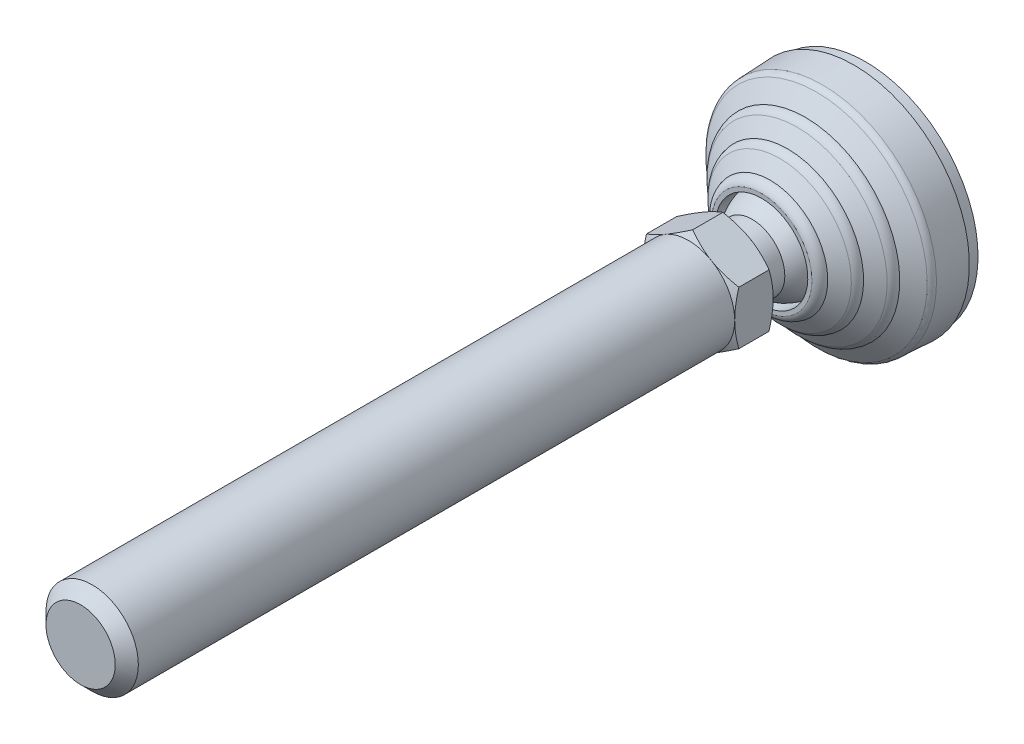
ISO-10303-21;
HEADER;
FILE_DESCRIPTION(('STEP AP214'),'2;1');
FILE_NAME('part.step','',(''),(''),'','','');
FILE_SCHEMA(('AUTOMOTIVE_DESIGN { 1 0 10303 214 1 1 1 1 }'));
ENDSEC;
DATA;
#1=APPLICATION_CONTEXT('core data for automotive mechanical design processes');
#2=APPLICATION_PROTOCOL_DEFINITION('international standard','automotive_design',2000,#1);
#3=PRODUCT_CONTEXT('',#1,'mechanical');
#4=PRODUCT('Part','Part','',(#3));
#5=PRODUCT_RELATED_PRODUCT_CATEGORY('part','',(#4));
#6=PRODUCT_DEFINITION_FORMATION('','',#4);
#7=PRODUCT_DEFINITION_CONTEXT('part definition',#1,'design');
#8=PRODUCT_DEFINITION('design','',#6,#7);
#9=PRODUCT_DEFINITION_SHAPE('','',#8);
#10=(LENGTH_UNIT() NAMED_UNIT(*) SI_UNIT(.MILLI.,.METRE.));
#11=(NAMED_UNIT(*) PLANE_ANGLE_UNIT() SI_UNIT($,.RADIAN.));
#12=(NAMED_UNIT(*) SI_UNIT($,.STERADIAN.) SOLID_ANGLE_UNIT());
#13=UNCERTAINTY_MEASURE_WITH_UNIT(LENGTH_MEASURE(1.E-05),#10,'distance_accuracy_value','');
#14=(GEOMETRIC_REPRESENTATION_CONTEXT(3) GLOBAL_UNCERTAINTY_ASSIGNED_CONTEXT((#13)) GLOBAL_UNIT_ASSIGNED_CONTEXT((#10,
#11,#12)) REPRESENTATION_CONTEXT('',''));
#15=CARTESIAN_POINT('',(0.,0.,0.));
#16=DIRECTION('',(0.,0.,1.));
#17=DIRECTION('',(1.,0.,0.));
#18=AXIS2_PLACEMENT_3D('',#15,#16,#17);
#19=CARTESIAN_POINT('',(0.,0.,93.1595));
#20=DIRECTION('',(0.,0.,-1.));
#21=DIRECTION('',(0.,1.,0.));
#22=AXIS2_PLACEMENT_3D('',#19,#20,#21);
#23=CYLINDRICAL_SURFACE('',#22,12.);
#24=CARTESIAN_POINT('',(0.,0.,201.));
#25=DIRECTION('',(0.,0.,1.));
#26=DIRECTION('',(0.,-1.,0.));
#27=AXIS2_PLACEMENT_3D('',#24,#25,#26);
#28=CIRCLE('',#27,12.);
#29=CARTESIAN_POINT('',(0.,-12.,201.));
#30=VERTEX_POINT('',#29);
#31=EDGE_CURVE('E9',#30,#30,#28,.F.);
#32=ORIENTED_EDGE('',*,*,#31,.T.);
#33=EDGE_LOOP('',(#32));
#34=FACE_BOUND('',#33,.T.);
#35=CARTESIAN_POINT('',(0.,0.,46.));
#36=DIRECTION('',(0.,0.,-1.));
#37=DIRECTION('',(0.,1.,0.));
#38=AXIS2_PLACEMENT_3D('',#35,#36,#37);
#39=CIRCLE('',#38,12.);
#40=CARTESIAN_POINT('',(0.,12.,46.));
#41=VERTEX_POINT('',#40);
#42=EDGE_CURVE('E124',#41,#41,#39,.F.);
#43=ORIENTED_EDGE('',*,*,#42,.T.);
#44=EDGE_LOOP('',(#43));
#45=FACE_BOUND('',#44,.T.);
#46=ADVANCED_FACE('F14',(#34,#45),#23,.T.);
#47=CARTESIAN_POINT('',(11.995,0.,46.));
#48=DIRECTION('',(0.,0.,-1.));
#49=DIRECTION('',(0.,1.,0.));
#50=AXIS2_PLACEMENT_3D('',#47,#48,#49);
#51=PLANE('',#50);
#52=CARTESIAN_POINT('',(0.,0.,46.));
#53=DIRECTION('',(0.,0.,-1.));
#54=DIRECTION('',(0.,1.,0.));
#55=AXIS2_PLACEMENT_3D('',#52,#53,#54);
#56=CIRCLE('',#55,11.99);
#57=CARTESIAN_POINT('',(0.,11.99,46.));
#58=VERTEX_POINT('',#57);
#59=EDGE_CURVE('E132',#58,#58,#56,.F.);
#60=ORIENTED_EDGE('',*,*,#59,.T.);
#61=EDGE_LOOP('',(#60));
#62=FACE_BOUND('',#61,.T.);
#63=ORIENTED_EDGE('',*,*,#42,.F.);
#64=EDGE_LOOP('',(#63));
#65=FACE_BOUND('',#64,.T.);
#66=ADVANCED_FACE('F157',(#62,#65),#51,.T.);
#67=CARTESIAN_POINT('',(0.,0.,44.9159643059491));
#68=DIRECTION('',(0.,0.,-1.));
#69=DIRECTION('',(0.,1.,0.));
#70=AXIS2_PLACEMENT_3D('',#67,#68,#69);
#71=CONICAL_SURFACE('',#70,13.8676048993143,1.0471975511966);
#72=ORIENTED_EDGE('',*,*,#59,.F.);
#73=EDGE_LOOP('',(#72));
#74=FACE_BOUND('',#73,.T.);
#75=CARTESIAN_POINT('',(-2.88482840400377E-08,-13.8564064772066,44.9224297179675));
#76=CARTESIAN_POINT('',(0.263784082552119,-13.7041106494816,45.010340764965));
#77=CARTESIAN_POINT('',(0.528551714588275,-13.5512469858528,45.0942615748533));
#78=CARTESIAN_POINT('',(1.06021019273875,-13.2442938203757,45.2530155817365));
#79=CARTESIAN_POINT('',(1.32710170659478,-13.0902039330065,45.3278457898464));
#80=CARTESIAN_POINT('',(2.13207647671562,-12.6254515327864,45.537252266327));
#81=CARTESIAN_POINT('',(2.67333741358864,-12.3129543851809,45.6563603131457));
#82=CARTESIAN_POINT('',(3.48330954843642,-11.8453167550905,45.796023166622));
#83=CARTESIAN_POINT('',(3.74960108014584,-11.6915732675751,45.8358073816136));
#84=CARTESIAN_POINT('',(4.28341699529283,-11.3833745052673,45.9025217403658));
#85=CARTESIAN_POINT('',(4.55094140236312,-11.2289192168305,45.9294516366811));
#86=CARTESIAN_POINT('',(5.08643614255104,-10.9197511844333,45.9697675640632));
#87=CARTESIAN_POINT('',(5.35440556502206,-10.7650389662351,45.9831696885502));
#88=CARTESIAN_POINT('',(5.8905925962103,-10.4554712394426,45.996144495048));
#89=CARTESIAN_POINT('',(6.15881019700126,-10.3006157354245,45.9957176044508));
#90=CARTESIAN_POINT('',(6.66023029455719,-10.0111207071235,45.9820002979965));
#91=CARTESIAN_POINT('',(6.89346857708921,-9.87646052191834,45.97038309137));
#92=CARTESIAN_POINT('',(7.35940867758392,-9.60744987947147,45.9369099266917));
#93=CARTESIAN_POINT('',(7.59211045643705,-9.47309944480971,45.9150532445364));
#94=CARTESIAN_POINT('',(8.05685109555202,-9.20478131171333,45.8614821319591));
#95=CARTESIAN_POINT('',(8.28888924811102,-9.07081402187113,45.8297595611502));
#96=CARTESIAN_POINT('',(8.75187776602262,-8.80350747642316,45.7570131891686));
#97=CARTESIAN_POINT('',(8.98282805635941,-8.67016826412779,45.7159887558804));
#98=CARTESIAN_POINT('',(9.68388987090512,-8.26541003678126,45.5779256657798));
#99=CARTESIAN_POINT('',(10.1519713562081,-7.99516306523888,45.4671213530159));
#100=CARTESIAN_POINT('',(11.081155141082,-7.45869855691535,45.2156417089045));
#101=CARTESIAN_POINT('',(11.5422693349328,-7.19247415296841,45.075025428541));
#102=CARTESIAN_POINT('',(11.9999999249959,-6.92820327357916,44.922429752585));
#103=B_SPLINE_CURVE_WITH_KNOTS('',3,(#75,#76,#77,#78,#79,#80,#81,#82,#83,#84,#85,#86,#87,#88,
#89,#90,#91,#92,#93,#94,#95,#96,#97,#98,#99,#100,#101,#102),.UNSPECIFIED.,.F.,.F.,(4,2,2,2,2,2,
2,2,2,2,2,2,2,4),(0.,0.950996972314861,1.90230578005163,3.80897261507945,4.73890631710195,
5.6688579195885,6.59770188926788,7.52651715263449,8.33503482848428,9.14360968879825,
9.95285348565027,10.7621522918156,12.4163368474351,14.0672749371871),.UNSPECIFIED.);
#104=CARTESIAN_POINT('',(-1.44241383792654E-08,-13.8564064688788,44.9224297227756));
#105=VERTEX_POINT('',#104);
#106=CARTESIAN_POINT('',(12.,-6.92820324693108,44.9224297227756));
#107=VERTEX_POINT('',#106);
#108=EDGE_CURVE('E143',#105,#107,#103,.T.);
#109=ORIENTED_EDGE('',*,*,#108,.T.);
#110=CARTESIAN_POINT('',(12.,-6.92820326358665,44.9224297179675));
#111=CARTESIAN_POINT('',(12.,-6.64374493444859,45.0045333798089));
#112=CARTESIAN_POINT('',(12.,-6.35829458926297,45.0831531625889));
#113=CARTESIAN_POINT('',(12.,-5.78524260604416,45.2325348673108));
#114=CARTESIAN_POINT('',(12.,-5.49764024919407,45.3032940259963));
#115=CARTESIAN_POINT('',(12.,-4.63053083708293,45.5026195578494));
#116=CARTESIAN_POINT('',(12.,-4.04782834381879,45.6179071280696));
#117=CARTESIAN_POINT('',(12.,-3.17548925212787,45.7575170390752));
#118=CARTESIAN_POINT('',(12.,-2.88840964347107,45.7982045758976));
#119=CARTESIAN_POINT('',(12.,-2.31290718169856,45.8685767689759));
#120=CARTESIAN_POINT('',(12.,-2.02448443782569,45.8982623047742));
#121=CARTESIAN_POINT('',(12.,-1.44696804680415,45.9459902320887));
#122=CARTESIAN_POINT('',(12.,-1.15787537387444,45.9640443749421));
#123=CARTESIAN_POINT('',(12.,-0.579188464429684,45.9881624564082));
#124=CARTESIAN_POINT('',(12.,-0.289594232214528,45.994226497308));
#125=CARTESIAN_POINT('',(12.,0.289594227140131,45.9942264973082));
#126=CARTESIAN_POINT('',(12.,0.579188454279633,45.9881624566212));
#127=CARTESIAN_POINT('',(12.,1.15787535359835,45.9640443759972));
#128=CARTESIAN_POINT('',(12.,1.44696802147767,45.9459902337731));
#129=CARTESIAN_POINT('',(12.,2.02448440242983,45.8982623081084));
#130=CARTESIAN_POINT('',(12.,2.31290714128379,45.8685767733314));
#131=CARTESIAN_POINT('',(12.,2.88840959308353,45.798204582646));
#132=CARTESIAN_POINT('',(12.,3.17548919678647,45.7575170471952));
#133=CARTESIAN_POINT('',(12.,4.04782827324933,45.6179071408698));
#134=CARTESIAN_POINT('',(12.,4.63053075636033,45.5026195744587));
#135=CARTESIAN_POINT('',(12.,5.49764015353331,45.3032940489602));
#136=CARTESIAN_POINT('',(12.,5.78524250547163,45.2325348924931));
#137=CARTESIAN_POINT('',(12.,6.35829447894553,45.0831531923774));
#138=CARTESIAN_POINT('',(12.,6.64374481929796,45.004533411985));
#139=CARTESIAN_POINT('',(12.,6.92820314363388,44.9224297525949));
#140=B_SPLINE_CURVE_WITH_KNOTS('',3,(#110,#111,#112,#113,#114,#115,#116,#117,#118,#119,#120,
#121,#122,#123,#124,#125,#126,#127,#128,#129,#130,#131,#132,#133,#134,#135,#136,#137,#138,#139),
.UNSPECIFIED.,.F.,.F.,(4,2,2,2,2,2,2,2,2,2,2,2,2,2,4),(0.,0.888148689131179,1.77660860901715,
3.55698615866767,4.42666281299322,5.2962699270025,6.16499708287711,7.03371682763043,
7.90243655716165,8.7711636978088,9.64077079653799,10.5104474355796,12.2908249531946,
13.1792848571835,14.0674335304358),.UNSPECIFIED.);
#141=CARTESIAN_POINT('',(12.0000000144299,6.92820322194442,44.9224297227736));
#142=VERTEX_POINT('',#141);
#143=EDGE_CURVE('E135',#107,#142,#140,.T.);
#144=ORIENTED_EDGE('',*,*,#143,.T.);
#145=CARTESIAN_POINT('',(12.0000000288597,6.92820321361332,44.9224297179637));
#146=CARTESIAN_POINT('',(11.7362159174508,7.08049904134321,45.0103407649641));
#147=CARTESIAN_POINT('',(11.4714482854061,7.23336270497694,45.0942615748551));
#148=CARTESIAN_POINT('',(10.9397898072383,7.54031587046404,45.2530155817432));
#149=CARTESIAN_POINT('',(10.6728982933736,7.69440575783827,45.3278457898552));
#150=CARTESIAN_POINT('',(9.86792352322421,8.15915815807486,45.5372522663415));
#151=CARTESIAN_POINT('',(9.32666258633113,8.47165530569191,45.6563603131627));
#152=CARTESIAN_POINT('',(8.51669045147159,8.93929293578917,45.7960231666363));
#153=CARTESIAN_POINT('',(8.25039891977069,9.0930364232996,45.8358073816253));
#154=CARTESIAN_POINT('',(7.71658300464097,9.40123518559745,45.9025217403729));
#155=CARTESIAN_POINT('',(7.44905859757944,9.55569047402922,45.9294516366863));
#156=CARTESIAN_POINT('',(6.91356385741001,9.86485850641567,45.9697675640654));
#157=CARTESIAN_POINT('',(6.64559443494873,10.0195707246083,45.9831696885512));
#158=CARTESIAN_POINT('',(6.10940740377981,10.3291384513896,45.996144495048));
#159=CARTESIAN_POINT('',(5.84118980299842,10.4839939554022,45.9957176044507));
#160=CARTESIAN_POINT('',(5.33976970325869,10.773488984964,45.9820002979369));
#161=CARTESIAN_POINT('',(5.10653141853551,10.9081491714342,45.970383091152));
#162=CARTESIAN_POINT('',(4.64059131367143,11.1771598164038,45.9369099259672));
#163=CARTESIAN_POINT('',(4.4078895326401,11.3115102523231,45.9150532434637));
#164=CARTESIAN_POINT('',(3.94314888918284,11.5798283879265,45.8614821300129));
#165=CARTESIAN_POINT('',(3.71111073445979,11.7137956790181,45.8297595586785));
#166=CARTESIAN_POINT('',(3.24812221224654,11.9811022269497,45.7570131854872));
#167=CARTESIAN_POINT('',(3.01717191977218,12.1144414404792,45.7159887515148));
#168=CARTESIAN_POINT('',(2.31611009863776,12.5191996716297,45.5779256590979));
#169=CARTESIAN_POINT('',(1.84802860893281,12.7894466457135,45.4671213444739));
#170=CARTESIAN_POINT('',(0.918844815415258,13.3259111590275,45.2156416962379));
#171=CARTESIAN_POINT('',(0.457730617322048,13.5921355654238,45.0750254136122));
#172=CARTESIAN_POINT('',(2.30778996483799E-08,13.856406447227,44.9224297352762));
#173=B_SPLINE_CURVE_WITH_KNOTS('',3,(#145,#146,#147,#148,#149,#150,#151,#152,#153,#154,#155,
#156,#157,#158,#159,#160,#161,#162,#163,#164,#165,#166,#167,#168,#169,#170,#171,#172),
.UNSPECIFIED.,.F.,.F.,(4,2,2,2,2,2,2,2,2,2,2,2,2,4),(0.,0.95099697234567,1.9023057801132,
3.8089726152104,4.73890631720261,5.66885791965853,6.59770188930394,7.52651715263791,
8.33503483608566,9.14360970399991,9.95285350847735,10.7621523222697,12.4163368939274,
14.0672749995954),.UNSPECIFIED.);
#174=CARTESIAN_POINT('',(-1.15389586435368E-08,13.856406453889,44.92242973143));
#175=VERTEX_POINT('',#174);
#176=EDGE_CURVE('E180',#142,#175,#173,.T.);
#177=ORIENTED_EDGE('',*,*,#176,.T.);
#178=CARTESIAN_POINT('',(-2.30779106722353E-08,13.856406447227,44.9224297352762));
#179=CARTESIAN_POINT('',(-0.263784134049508,13.7041106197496,45.0103407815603));
#180=CARTESIAN_POINT('',(-0.528551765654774,13.5512469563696,45.0942615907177));
#181=CARTESIAN_POINT('',(-1.06021024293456,13.2442937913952,45.2530155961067));
#182=CARTESIAN_POINT('',(-1.32710175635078,13.0902039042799,45.3278458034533));
#183=CARTESIAN_POINT('',(-2.13207652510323,12.6254515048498,45.5372522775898));
#184=CARTESIAN_POINT('',(-2.67333746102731,12.3129543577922,45.656360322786));
#185=CARTESIAN_POINT('',(-3.48330959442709,11.8453167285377,45.7960231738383));
#186=CARTESIAN_POINT('',(-3.74960112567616,11.6915732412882,45.8358073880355));
#187=CARTESIAN_POINT('',(-4.28341703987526,11.3833744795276,45.9025217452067));
#188=CARTESIAN_POINT('',(-4.55094144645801,11.2289191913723,45.9294516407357));
#189=CARTESIAN_POINT('',(-5.08643618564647,10.9197511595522,45.9697675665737));
#190=CARTESIAN_POINT('',(-5.35440560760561,10.7650389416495,45.9831696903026));
#191=CARTESIAN_POINT('',(-5.89059263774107,10.4554712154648,45.9961444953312));
#192=CARTESIAN_POINT('',(-6.15881023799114,10.300615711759,45.9957176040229));
#193=CARTESIAN_POINT('',(-6.66023033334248,10.0111206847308,45.9820002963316));
#194=CARTESIAN_POINT('',(-6.89346861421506,9.87646050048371,45.9703830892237));
#195=CARTESIAN_POINT('',(-7.35940871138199,9.60744985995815,45.9369099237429));
#196=CARTESIAN_POINT('',(-7.59211048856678,9.4730994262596,45.9150532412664));
#197=CARTESIAN_POINT('',(-8.05685112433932,9.20478129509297,45.8614821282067));
#198=CARTESIAN_POINT('',(-8.28888927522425,9.0708140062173,45.8297595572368));
#199=CARTESIAN_POINT('',(-8.75187778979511,8.8035074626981,45.7570131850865));
#200=CARTESIAN_POINT('',(-8.98282807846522,8.67016825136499,45.7159887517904));
#201=CARTESIAN_POINT('',(-9.68388988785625,8.26541002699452,45.5779256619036));
#202=CARTESIAN_POINT('',(-10.1519713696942,7.9951630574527,45.4671213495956));
#203=CARTESIAN_POINT('',(-11.0811551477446,7.45869855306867,45.2156417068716));
#204=CARTESIAN_POINT('',(-11.5422693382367,7.19247415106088,45.0750254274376));
#205=CARTESIAN_POINT('',(-11.9999999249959,6.92820327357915,44.922429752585));
#206=B_SPLINE_CURVE_WITH_KNOTS('',3,(#178,#179,#180,#181,#182,#183,#184,#185,#186,#187,#188,
#189,#190,#191,#192,#193,#194,#195,#196,#197,#198,#199,#200,#201,#202,#203,#204,#205),
.UNSPECIFIED.,.F.,.F.,(4,2,2,2,2,2,2,2,2,2,2,2,2,4),(0.,0.9509969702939,1.90230577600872,
3.80897260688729,4.73890630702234,5.6688579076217,6.5977018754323,7.52651713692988,
8.33503480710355,9.14360966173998,9.95285345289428,10.7621522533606,12.4163367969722,
14.067274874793),.UNSPECIFIED.);
#207=CARTESIAN_POINT('',(-12.,6.92820324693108,44.9224297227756));
#208=VERTEX_POINT('',#207);
#209=EDGE_CURVE('E172',#175,#208,#206,.T.);
#210=ORIENTED_EDGE('',*,*,#209,.T.);
#211=CARTESIAN_POINT('',(-12.,6.92820326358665,44.9224297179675));
#212=CARTESIAN_POINT('',(-12.,6.64374493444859,45.0045333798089));
#213=CARTESIAN_POINT('',(-12.,6.35829458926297,45.0831531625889));
#214=CARTESIAN_POINT('',(-12.,5.78524260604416,45.2325348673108));
#215=CARTESIAN_POINT('',(-12.,5.49764024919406,45.3032940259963));
#216=CARTESIAN_POINT('',(-12.,4.63053083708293,45.5026195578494));
#217=CARTESIAN_POINT('',(-12.,4.04782834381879,45.6179071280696));
#218=CARTESIAN_POINT('',(-12.,3.17548925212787,45.7575170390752));
#219=CARTESIAN_POINT('',(-12.,2.88840964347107,45.7982045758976));
#220=CARTESIAN_POINT('',(-12.,2.31290718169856,45.8685767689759));
#221=CARTESIAN_POINT('',(-12.,2.02448443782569,45.8982623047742));
#222=CARTESIAN_POINT('',(-12.,1.44696804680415,45.9459902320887));
#223=CARTESIAN_POINT('',(-12.,1.15787537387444,45.9640443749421));
#224=CARTESIAN_POINT('',(-12.,0.579188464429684,45.9881624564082));
#225=CARTESIAN_POINT('',(-12.,0.289594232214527,45.994226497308));
#226=CARTESIAN_POINT('',(-12.,-0.289594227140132,45.9942264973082));
#227=CARTESIAN_POINT('',(-12.,-0.579188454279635,45.9881624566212));
#228=CARTESIAN_POINT('',(-12.,-1.15787535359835,45.9640443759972));
#229=CARTESIAN_POINT('',(-12.,-1.44696802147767,45.9459902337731));
#230=CARTESIAN_POINT('',(-12.,-2.02448440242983,45.8982623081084));
#231=CARTESIAN_POINT('',(-12.,-2.31290714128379,45.8685767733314));
#232=CARTESIAN_POINT('',(-12.,-2.88840959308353,45.798204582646));
#233=CARTESIAN_POINT('',(-12.,-3.17548919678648,45.7575170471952));
#234=CARTESIAN_POINT('',(-12.,-4.04782827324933,45.6179071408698));
#235=CARTESIAN_POINT('',(-12.,-4.63053075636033,45.5026195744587));
#236=CARTESIAN_POINT('',(-12.,-5.49764015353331,45.3032940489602));
#237=CARTESIAN_POINT('',(-12.,-5.78524250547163,45.2325348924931));
#238=CARTESIAN_POINT('',(-12.,-6.35829447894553,45.0831531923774));
#239=CARTESIAN_POINT('',(-12.,-6.64374481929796,45.004533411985));
#240=CARTESIAN_POINT('',(-12.,-6.92820314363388,44.9224297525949));
#241=B_SPLINE_CURVE_WITH_KNOTS('',3,(#211,#212,#213,#214,#215,#216,#217,#218,#219,#220,#221,
#222,#223,#224,#225,#226,#227,#228,#229,#230,#231,#232,#233,#234,#235,#236,#237,#238,#239,#240),
.UNSPECIFIED.,.F.,.F.,(4,2,2,2,2,2,2,2,2,2,2,2,2,2,4),(0.,0.888148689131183,1.77660860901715,
3.55698615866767,4.42666281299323,5.2962699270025,6.16499708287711,7.03371682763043,
7.90243655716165,8.7711636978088,9.64077079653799,10.5104474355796,12.2908249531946,
13.1792848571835,14.0674335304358),.UNSPECIFIED.);
#242=CARTESIAN_POINT('',(-12.0000000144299,-6.92820322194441,44.9224297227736));
#243=VERTEX_POINT('',#242);
#244=EDGE_CURVE('E350',#208,#243,#241,.T.);
#245=ORIENTED_EDGE('',*,*,#244,.T.);
#246=CARTESIAN_POINT('',(-12.0000000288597,-6.92820321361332,44.9224297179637));
#247=CARTESIAN_POINT('',(-11.7362159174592,-7.08049904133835,45.0103407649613));
#248=CARTESIAN_POINT('',(-11.471448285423,-7.23336270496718,45.0942615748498));
#249=CARTESIAN_POINT('',(-10.9397898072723,-7.54031587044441,45.2530155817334));
#250=CARTESIAN_POINT('',(-10.6728982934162,-7.69440575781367,45.3278457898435));
#251=CARTESIAN_POINT('',(-9.86792352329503,-8.15915815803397,45.5372522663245));
#252=CARTESIAN_POINT('',(-9.32666258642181,-8.47165530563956,45.6563603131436));
#253=CARTESIAN_POINT('',(-8.51669045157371,-8.93929293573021,45.7960231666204));
#254=CARTESIAN_POINT('',(-8.25039891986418,-9.09303642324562,45.8358073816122));
#255=CARTESIAN_POINT('',(-7.71658300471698,-9.40123518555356,45.9025217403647));
#256=CARTESIAN_POINT('',(-7.44905859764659,-9.55569047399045,45.9294516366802));
#257=CARTESIAN_POINT('',(-6.91356385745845,-9.8648585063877,45.9697675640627));
#258=CARTESIAN_POINT('',(-6.64559443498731,-10.019570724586,45.9831696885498));
#259=CARTESIAN_POINT('',(-6.10940740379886,-10.3291384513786,45.996144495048));
#260=CARTESIAN_POINT('',(-5.84118980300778,-10.4839939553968,45.9957176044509));
#261=CARTESIAN_POINT('',(-5.33976970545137,-10.7734889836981,45.9820002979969));
#262=CARTESIAN_POINT('',(-5.10653142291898,-10.9081491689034,45.9703830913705));
#263=CARTESIAN_POINT('',(-4.64059132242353,-11.1771598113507,45.9369099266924));
#264=CARTESIAN_POINT('',(-4.40788954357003,-11.3115102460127,45.9150532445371));
#265=CARTESIAN_POINT('',(-3.94314890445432,-11.5798283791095,45.8614821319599));
#266=CARTESIAN_POINT('',(-3.71111075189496,-11.7137956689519,45.8297595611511));
#267=CARTESIAN_POINT('',(-3.24812223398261,-11.9811022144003,45.7570131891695));
#268=CARTESIAN_POINT('',(-3.01717194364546,-12.1144414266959,45.7159887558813));
#269=CARTESIAN_POINT('',(-2.3161101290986,-12.5191996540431,45.5779256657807));
#270=CARTESIAN_POINT('',(-1.84802864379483,-12.7894466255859,45.4671213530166));
#271=CARTESIAN_POINT('',(-0.918844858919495,-13.3259111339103,45.215641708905));
#272=CARTESIAN_POINT('',(-0.457730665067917,-13.5921355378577,45.0750254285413));
#273=CARTESIAN_POINT('',(-7.50040968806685E-08,-13.8564064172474,44.922429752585));
#274=B_SPLINE_CURVE_WITH_KNOTS('',3,(#246,#247,#248,#249,#250,#251,#252,#253,#254,#255,#256,
#257,#258,#259,#260,#261,#262,#263,#264,#265,#266,#267,#268,#269,#270,#271,#272,#273),
.UNSPECIFIED.,.F.,.F.,(4,2,2,2,2,2,2,2,2,2,2,2,2,4),(0.,0.950996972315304,1.90230578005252,
3.80897261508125,4.73890631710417,5.66885791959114,6.59770188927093,7.52651715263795,
8.33503482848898,9.14360968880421,9.95285348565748,10.7621522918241,12.4163368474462,
14.0672749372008),.UNSPECIFIED.);
#275=EDGE_CURVE('E162',#243,#105,#274,.T.);
#276=ORIENTED_EDGE('',*,*,#275,.T.);
#277=EDGE_LOOP('',(#109,#144,#177,#210,#245,#276));
#278=FACE_BOUND('',#277,.T.);
#279=ADVANCED_FACE('F152',(#74,#278),#71,.T.);
#280=CARTESIAN_POINT('',(0.,-13.856406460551,46.1));
#281=DIRECTION('',(0.5,0.866025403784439,0.));
#282=DIRECTION('',(-0.866025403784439,0.5,0.));
#283=AXIS2_PLACEMENT_3D('',#280,#281,#282);
#284=PLANE('',#283);
#285=DIRECTION('',(0.,0.,1.));
#286=VECTOR('',#285,1.);
#287=CARTESIAN_POINT('',(0.,-13.856406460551,46.1));
#288=LINE('',#287,#286);
#289=CARTESIAN_POINT('',(0.,-13.856406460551,37.0775702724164));
#290=VERTEX_POINT('',#289);
#291=EDGE_CURVE('E376',#290,#105,#288,.T.);
#292=ORIENTED_EDGE('',*,*,#291,.T.);
#293=ORIENTED_EDGE('',*,*,#275,.F.);
#294=DIRECTION('',(0.,0.,1.));
#295=VECTOR('',#294,1.);
#296=CARTESIAN_POINT('',(-12.,-6.9282032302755,46.1));
#297=LINE('',#296,#295);
#298=CARTESIAN_POINT('',(-12.,-6.9282032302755,37.0775702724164));
#299=VERTEX_POINT('',#298);
#300=EDGE_CURVE('E368',#299,#243,#297,.T.);
#301=ORIENTED_EDGE('',*,*,#300,.F.);
#302=CARTESIAN_POINT('',(0.,-13.856406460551,37.0775702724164));
#303=CARTESIAN_POINT('',(-0.263784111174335,-13.7041106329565,36.9896592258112));
#304=CARTESIAN_POINT('',(-0.528551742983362,-13.5512469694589,36.9057384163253));
#305=CARTESIAN_POINT('',(-1.0602102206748,-13.2442938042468,36.7469844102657));
#306=CARTESIAN_POINT('',(-1.32710173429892,-13.0902039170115,36.6721542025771));
#307=CARTESIAN_POINT('',(-2.13207650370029,-12.6254515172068,36.4627477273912));
#308=CARTESIAN_POINT('',(-2.67333744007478,-12.3129543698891,36.3436396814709));
#309=CARTESIAN_POINT('',(-3.48330957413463,-11.8453167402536,36.2039768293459));
#310=CARTESIAN_POINT('',(-3.74960110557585,-11.6915732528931,36.1641926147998));
#311=CARTESIAN_POINT('',(-4.28341702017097,-11.3833744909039,36.097478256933));
#312=CARTESIAN_POINT('',(-4.55094142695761,-11.2289192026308,36.0705483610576));
#313=CARTESIAN_POINT('',(-5.08643616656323,-10.9197511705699,36.0302324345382));
#314=CARTESIAN_POINT('',(-5.35440558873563,-10.765038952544,36.0168303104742));
#315=CARTESIAN_POINT('',(-5.89059261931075,-10.4554712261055,36.0038555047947));
#316=CARTESIAN_POINT('',(-6.15881021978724,-10.300615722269,36.0042823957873));
#317=CARTESIAN_POINT('',(-6.66023031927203,-10.0111206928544,36.0179997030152));
#318=CARTESIAN_POINT('',(-6.8934686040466,-9.87646050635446,36.029616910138));
#319=CARTESIAN_POINT('',(-7.35940870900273,-9.6074498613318,36.063090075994));
#320=CARTESIAN_POINT('',(-7.59211049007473,-9.47309942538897,36.0849467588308));
#321=CARTESIAN_POINT('',(-8.05685113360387,-9.20478128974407,36.1385178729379));
#322=CARTESIAN_POINT('',(-8.28888928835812,-9.07081399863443,36.1702404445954));
#323=CARTESIAN_POINT('',(-8.75187781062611,-8.8035074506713,36.2429868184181));
#324=CARTESIAN_POINT('',(-8.98282810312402,-8.67016823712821,36.2840112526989));
#325=CARTESIAN_POINT('',(-9.6838899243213,-8.2654100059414,36.4220743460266));
#326=CARTESIAN_POINT('',(-10.1519714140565,-7.99516303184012,36.5328786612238));
#327=CARTESIAN_POINT('',(-11.0811552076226,-7.45869851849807,36.7843583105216));
#328=CARTESIAN_POINT('',(-11.5422694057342,-7.19247411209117,36.924974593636));
#329=CARTESIAN_POINT('',(-12.,-6.9282032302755,37.0775702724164));
#330=B_SPLINE_CURVE_WITH_KNOTS('',3,(#302,#303,#304,#305,#306,#307,#308,#309,#310,#311,#312,
#313,#314,#315,#316,#317,#318,#319,#320,#321,#322,#323,#324,#325,#326,#327,#328,#329),
.UNSPECIFIED.,.F.,.F.,(4,2,2,2,2,2,2,2,2,2,2,2,2,4),(0.,0.950996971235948,1.90230577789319,
3.80897261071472,4.73890631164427,5.66885791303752,6.59770188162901,7.52651714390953,
8.33503482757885,9.14360969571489,9.9528535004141,10.7621523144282,12.4163368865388,
14.0672749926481),.UNSPECIFIED.);
#331=EDGE_CURVE('E370',#290,#299,#330,.T.);
#332=ORIENTED_EDGE('',*,*,#331,.F.);
#333=EDGE_LOOP('',(#292,#293,#301,#332));
#334=FACE_BOUND('',#333,.T.);
#335=ADVANCED_FACE('F156',(#334),#284,.F.);
#336=CARTESIAN_POINT('',(12.,-6.92820323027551,46.1));
#337=DIRECTION('',(-0.5,0.866025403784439,0.));
#338=DIRECTION('',(-0.866025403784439,-0.5,0.));
#339=AXIS2_PLACEMENT_3D('',#336,#337,#338);
#340=PLANE('',#339);
#341=DIRECTION('',(0.,0.,1.));
#342=VECTOR('',#341,1.);
#343=CARTESIAN_POINT('',(12.,-6.92820323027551,46.1));
#344=LINE('',#343,#342);
#345=CARTESIAN_POINT('',(12.,-6.92820323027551,37.0775702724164));
#346=VERTEX_POINT('',#345);
#347=EDGE_CURVE('E31',#346,#107,#344,.T.);
#348=ORIENTED_EDGE('',*,*,#347,.T.);
#349=ORIENTED_EDGE('',*,*,#108,.F.);
#350=ORIENTED_EDGE('',*,*,#291,.F.);
#351=CARTESIAN_POINT('',(12.,-6.92820323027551,37.0775702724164));
#352=CARTESIAN_POINT('',(11.7362158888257,-7.08049905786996,36.9896592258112));
#353=CARTESIAN_POINT('',(11.4714482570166,-7.2333627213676,36.9057384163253));
#354=CARTESIAN_POINT('',(10.9397897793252,-7.5403158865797,36.7469844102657));
#355=CARTESIAN_POINT('',(10.6728982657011,-7.69440577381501,36.6721542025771));
#356=CARTESIAN_POINT('',(9.86792349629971,-8.15915817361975,36.4627477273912));
#357=CARTESIAN_POINT('',(9.32666255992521,-8.4716553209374,36.3436396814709));
#358=CARTESIAN_POINT('',(8.51669042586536,-8.93929295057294,36.2039768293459));
#359=CARTESIAN_POINT('',(8.25039889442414,-9.09303643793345,36.1641926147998));
#360=CARTESIAN_POINT('',(7.71658297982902,-9.40123519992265,36.097478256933));
#361=CARTESIAN_POINT('',(7.44905857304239,-9.55569048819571,36.0705483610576));
#362=CARTESIAN_POINT('',(6.91356383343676,-9.86485852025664,36.0302324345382));
#363=CARTESIAN_POINT('',(6.64559441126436,-10.0195707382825,36.0168303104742));
#364=CARTESIAN_POINT('',(6.10940738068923,-10.329138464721,36.0038555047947));
#365=CARTESIAN_POINT('',(5.84118978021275,-10.4839939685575,36.0042823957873));
#366=CARTESIAN_POINT('',(5.33976968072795,-10.7734889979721,36.0179997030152));
#367=CARTESIAN_POINT('',(5.10653139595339,-10.9081491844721,36.029616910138));
#368=CARTESIAN_POINT('',(4.64059129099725,-11.1771598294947,36.063090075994));
#369=CARTESIAN_POINT('',(4.40788950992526,-11.3115102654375,36.0849467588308));
#370=CARTESIAN_POINT('',(3.94314886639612,-11.5798284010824,36.1385178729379));
#371=CARTESIAN_POINT('',(3.71111071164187,-11.7137956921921,36.1702404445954));
#372=CARTESIAN_POINT('',(3.24812218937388,-11.9811022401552,36.2429868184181));
#373=CARTESIAN_POINT('',(3.01717189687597,-12.1144414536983,36.2840112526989));
#374=CARTESIAN_POINT('',(2.3161100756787,-12.5191996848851,36.4220743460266));
#375=CARTESIAN_POINT('',(1.84802858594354,-12.7894466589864,36.5328786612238));
#376=CARTESIAN_POINT('',(0.918844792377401,-13.3259111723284,36.7843583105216));
#377=CARTESIAN_POINT('',(0.457730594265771,-13.5921355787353,36.924974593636));
#378=CARTESIAN_POINT('',(0.,-13.856406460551,37.0775702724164));
#379=B_SPLINE_CURVE_WITH_KNOTS('',3,(#351,#352,#353,#354,#355,#356,#357,#358,#359,#360,#361,
#362,#363,#364,#365,#366,#367,#368,#369,#370,#371,#372,#373,#374,#375,#376,#377,#378),
.UNSPECIFIED.,.F.,.F.,(4,2,2,2,2,2,2,2,2,2,2,2,2,4),(0.,0.95099697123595,1.90230577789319,
3.80897261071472,4.73890631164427,5.66885791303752,6.59770188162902,7.52651714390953,
8.33503482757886,9.14360969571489,9.9528535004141,10.7621523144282,12.4163368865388,
14.0672749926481),.UNSPECIFIED.);
#380=EDGE_CURVE('E377',#346,#290,#379,.T.);
#381=ORIENTED_EDGE('',*,*,#380,.F.);
#382=EDGE_LOOP('',(#348,#349,#350,#381));
#383=FACE_BOUND('',#382,.T.);
#384=ADVANCED_FACE('F383',(#383),#340,.F.);
#385=CARTESIAN_POINT('',(-12.,6.92820323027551,46.1));
#386=DIRECTION('',(0.5,-0.866025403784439,0.));
#387=DIRECTION('',(0.866025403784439,0.5,0.));
#388=AXIS2_PLACEMENT_3D('',#385,#386,#387);
#389=PLANE('',#388);
#390=DIRECTION('',(0.,0.,1.));
#391=VECTOR('',#390,1.);
#392=CARTESIAN_POINT('',(-12.,6.92820323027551,46.1));
#393=LINE('',#392,#391);
#394=CARTESIAN_POINT('',(-12.,6.92820323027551,37.0775702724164));
#395=VERTEX_POINT('',#394);
#396=EDGE_CURVE('E369',#395,#208,#393,.T.);
#397=ORIENTED_EDGE('',*,*,#396,.T.);
#398=ORIENTED_EDGE('',*,*,#209,.F.);
#399=DIRECTION('',(0.,0.,1.));
#400=VECTOR('',#399,1.);
#401=CARTESIAN_POINT('',(0.,13.856406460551,46.1));
#402=LINE('',#401,#400);
#403=CARTESIAN_POINT('',(0.,13.856406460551,37.0775702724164));
#404=VERTEX_POINT('',#403);
#405=EDGE_CURVE('E211',#404,#175,#402,.T.);
#406=ORIENTED_EDGE('',*,*,#405,.F.);
#407=CARTESIAN_POINT('',(-12.,6.92820323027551,37.0775702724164));
#408=CARTESIAN_POINT('',(-11.7362158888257,7.08049905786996,36.9896592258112));
#409=CARTESIAN_POINT('',(-11.4714482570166,7.2333627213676,36.9057384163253));
#410=CARTESIAN_POINT('',(-10.9397897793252,7.5403158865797,36.7469844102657));
#411=CARTESIAN_POINT('',(-10.6728982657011,7.69440577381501,36.6721542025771));
#412=CARTESIAN_POINT('',(-9.86792349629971,8.15915817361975,36.4627477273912));
#413=CARTESIAN_POINT('',(-9.32666255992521,8.4716553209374,36.3436396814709));
#414=CARTESIAN_POINT('',(-8.51669042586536,8.93929295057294,36.2039768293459));
#415=CARTESIAN_POINT('',(-8.25039889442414,9.09303643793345,36.1641926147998));
#416=CARTESIAN_POINT('',(-7.71658297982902,9.40123519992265,36.097478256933));
#417=CARTESIAN_POINT('',(-7.44905857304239,9.55569048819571,36.0705483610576));
#418=CARTESIAN_POINT('',(-6.91356383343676,9.86485852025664,36.0302324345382));
#419=CARTESIAN_POINT('',(-6.64559441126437,10.0195707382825,36.0168303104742));
#420=CARTESIAN_POINT('',(-6.10940738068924,10.329138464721,36.0038555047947));
#421=CARTESIAN_POINT('',(-5.84118978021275,10.4839939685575,36.0042823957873));
#422=CARTESIAN_POINT('',(-5.33976968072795,10.7734889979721,36.0179997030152));
#423=CARTESIAN_POINT('',(-5.10653139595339,10.9081491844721,36.029616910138));
#424=CARTESIAN_POINT('',(-4.64059129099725,11.1771598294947,36.063090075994));
#425=CARTESIAN_POINT('',(-4.40788950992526,11.3115102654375,36.0849467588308));
#426=CARTESIAN_POINT('',(-3.94314886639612,11.5798284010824,36.1385178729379));
#427=CARTESIAN_POINT('',(-3.71111071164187,11.7137956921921,36.1702404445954));
#428=CARTESIAN_POINT('',(-3.24812218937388,11.9811022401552,36.2429868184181));
#429=CARTESIAN_POINT('',(-3.01717189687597,12.1144414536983,36.2840112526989));
#430=CARTESIAN_POINT('',(-2.3161100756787,12.5191996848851,36.4220743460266));
#431=CARTESIAN_POINT('',(-1.84802858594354,12.7894466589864,36.5328786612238));
#432=CARTESIAN_POINT('',(-0.918844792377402,13.3259111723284,36.7843583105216));
#433=CARTESIAN_POINT('',(-0.457730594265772,13.5921355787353,36.924974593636));
#434=CARTESIAN_POINT('',(0.,13.856406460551,37.0775702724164));
#435=B_SPLINE_CURVE_WITH_KNOTS('',3,(#407,#408,#409,#410,#411,#412,#413,#414,#415,#416,#417,
#418,#419,#420,#421,#422,#423,#424,#425,#426,#427,#428,#429,#430,#431,#432,#433,#434),
.UNSPECIFIED.,.F.,.F.,(4,2,2,2,2,2,2,2,2,2,2,2,2,4),(0.,0.95099697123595,1.90230577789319,
3.80897261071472,4.73890631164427,5.66885791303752,6.59770188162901,7.52651714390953,
8.33503482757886,9.14360969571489,9.9528535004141,10.7621523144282,12.4163368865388,
14.0672749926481),.UNSPECIFIED.);
#436=EDGE_CURVE('E213',#395,#404,#435,.T.);
#437=ORIENTED_EDGE('',*,*,#436,.F.);
#438=EDGE_LOOP('',(#397,#398,#406,#437));
#439=FACE_BOUND('',#438,.T.);
#440=ADVANCED_FACE('F199',(#439),#389,.F.);
#441=CARTESIAN_POINT('',(-12.,-6.92820323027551,46.1));
#442=DIRECTION('',(1.,0.,0.));
#443=DIRECTION('',(0.,1.,0.));
#444=AXIS2_PLACEMENT_3D('',#441,#442,#443);
#445=PLANE('',#444);
#446=ORIENTED_EDGE('',*,*,#300,.T.);
#447=ORIENTED_EDGE('',*,*,#244,.F.);
#448=ORIENTED_EDGE('',*,*,#396,.F.);
#449=CARTESIAN_POINT('',(-12.,-6.9282032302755,37.0775702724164));
#450=CARTESIAN_POINT('',(-12.,-6.64374490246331,36.9954666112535));
#451=CARTESIAN_POINT('',(-12.,-6.35829455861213,36.9168468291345));
#452=CARTESIAN_POINT('',(-12.,-5.78524257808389,36.7674651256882));
#453=CARTESIAN_POINT('',(-12.,-5.49764022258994,36.6967059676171));
#454=CARTESIAN_POINT('',(-12.,-4.63053081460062,36.4973804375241));
#455=CARTESIAN_POINT('',(-12.,-4.04782832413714,36.3820928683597));
#456=CARTESIAN_POINT('',(-12.,-3.17548923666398,36.2424829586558));
#457=CARTESIAN_POINT('',(-12.,-2.88840962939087,36.2017954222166));
#458=CARTESIAN_POINT('',(-12.,-2.31290717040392,36.1314232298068));
#459=CARTESIAN_POINT('',(-12.,-2.02448442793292,36.1017376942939));
#460=CARTESIAN_POINT('',(-12.,-1.44696803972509,36.0540097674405));
#461=CARTESIAN_POINT('',(-12.,-1.1578753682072,36.035955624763));
#462=CARTESIAN_POINT('',(-12.,-0.579188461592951,36.0118375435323));
#463=CARTESIAN_POINT('',(-12.,-0.289594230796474,36.0057735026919));
#464=CARTESIAN_POINT('',(-12.,0.28959423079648,36.0057735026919));
#465=CARTESIAN_POINT('',(-12.,0.579188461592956,36.0118375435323));
#466=CARTESIAN_POINT('',(-12.,1.15787536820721,36.035955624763));
#467=CARTESIAN_POINT('',(-12.,1.4469680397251,36.0540097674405));
#468=CARTESIAN_POINT('',(-12.,2.02448442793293,36.1017376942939));
#469=CARTESIAN_POINT('',(-12.,2.31290717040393,36.1314232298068));
#470=CARTESIAN_POINT('',(-12.,2.88840962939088,36.2017954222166));
#471=CARTESIAN_POINT('',(-12.,3.17548923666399,36.2424829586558));
#472=CARTESIAN_POINT('',(-12.,4.04782832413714,36.3820928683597));
#473=CARTESIAN_POINT('',(-12.,4.63053081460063,36.4973804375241));
#474=CARTESIAN_POINT('',(-12.,5.49764022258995,36.6967059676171));
#475=CARTESIAN_POINT('',(-12.,5.7852425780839,36.7674651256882));
#476=CARTESIAN_POINT('',(-12.,6.35829455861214,36.9168468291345));
#477=CARTESIAN_POINT('',(-12.,6.64374490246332,36.9954666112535));
#478=CARTESIAN_POINT('',(-12.,6.92820323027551,37.0775702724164));
#479=B_SPLINE_CURVE_WITH_KNOTS('',3,(#449,#450,#451,#452,#453,#454,#455,#456,#457,#458,#459,
#460,#461,#462,#463,#464,#465,#466,#467,#468,#469,#470,#471,#472,#473,#474,#475,#476,#477,#478),
.UNSPECIFIED.,.F.,.F.,(4,2,2,2,2,2,2,2,2,2,2,2,2,2,4),(0.,0.888148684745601,1.77660860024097,
3.55698614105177,4.42666279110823,5.29626990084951,6.16499705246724,7.03371679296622,
7.90243653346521,8.77116368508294,9.64077079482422,10.5104474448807,12.2908249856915,
13.1792849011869,14.0674335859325),.UNSPECIFIED.);
#480=EDGE_CURVE('E362',#299,#395,#479,.T.);
#481=ORIENTED_EDGE('',*,*,#480,.F.);
#482=EDGE_LOOP('',(#446,#447,#448,#481));
#483=FACE_BOUND('',#482,.T.);
#484=ADVANCED_FACE('F356',(#483),#445,.F.);
#485=CARTESIAN_POINT('',(12.,6.92820323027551,46.1));
#486=DIRECTION('',(-1.,0.,0.));
#487=DIRECTION('',(0.,-1.,0.));
#488=AXIS2_PLACEMENT_3D('',#485,#486,#487);
#489=PLANE('',#488);
#490=DIRECTION('',(0.,0.,1.));
#491=VECTOR('',#490,1.);
#492=CARTESIAN_POINT('',(12.,6.92820323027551,46.1));
#493=LINE('',#492,#491);
#494=CARTESIAN_POINT('',(12.,6.9282032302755,37.0775702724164));
#495=VERTEX_POINT('',#494);
#496=EDGE_CURVE('E410',#142,#495,#493,.F.);
#497=ORIENTED_EDGE('',*,*,#496,.F.);
#498=ORIENTED_EDGE('',*,*,#143,.F.);
#499=ORIENTED_EDGE('',*,*,#347,.F.);
#500=CARTESIAN_POINT('',(12.,6.92820323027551,37.0775702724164));
#501=CARTESIAN_POINT('',(12.,6.64374490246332,36.9954666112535));
#502=CARTESIAN_POINT('',(12.,6.35829455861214,36.9168468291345));
#503=CARTESIAN_POINT('',(12.,5.7852425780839,36.7674651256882));
#504=CARTESIAN_POINT('',(12.,5.49764022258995,36.6967059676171));
#505=CARTESIAN_POINT('',(12.,4.63053081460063,36.4973804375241));
#506=CARTESIAN_POINT('',(12.,4.04782832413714,36.3820928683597));
#507=CARTESIAN_POINT('',(12.,3.17548923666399,36.2424829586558));
#508=CARTESIAN_POINT('',(12.,2.88840962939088,36.2017954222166));
#509=CARTESIAN_POINT('',(12.,2.31290717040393,36.1314232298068));
#510=CARTESIAN_POINT('',(12.,2.02448442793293,36.1017376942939));
#511=CARTESIAN_POINT('',(12.,1.4469680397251,36.0540097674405));
#512=CARTESIAN_POINT('',(12.,1.1578753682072,36.035955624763));
#513=CARTESIAN_POINT('',(12.,0.579188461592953,36.0118375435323));
#514=CARTESIAN_POINT('',(12.,0.289594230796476,36.0057735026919));
#515=CARTESIAN_POINT('',(12.,-0.289594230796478,36.0057735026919));
#516=CARTESIAN_POINT('',(12.,-0.579188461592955,36.0118375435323));
#517=CARTESIAN_POINT('',(12.,-1.15787536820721,36.035955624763));
#518=CARTESIAN_POINT('',(12.,-1.4469680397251,36.0540097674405));
#519=CARTESIAN_POINT('',(12.,-2.02448442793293,36.1017376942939));
#520=CARTESIAN_POINT('',(12.,-2.31290717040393,36.1314232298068));
#521=CARTESIAN_POINT('',(12.,-2.88840962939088,36.2017954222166));
#522=CARTESIAN_POINT('',(12.,-3.17548923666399,36.2424829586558));
#523=CARTESIAN_POINT('',(12.,-4.04782832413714,36.3820928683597));
#524=CARTESIAN_POINT('',(12.,-4.63053081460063,36.4973804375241));
#525=CARTESIAN_POINT('',(12.,-5.49764022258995,36.6967059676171));
#526=CARTESIAN_POINT('',(12.,-5.7852425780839,36.7674651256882));
#527=CARTESIAN_POINT('',(12.,-6.35829455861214,36.9168468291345));
#528=CARTESIAN_POINT('',(12.,-6.64374490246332,36.9954666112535));
#529=CARTESIAN_POINT('',(12.,-6.92820323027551,37.0775702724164));
#530=B_SPLINE_CURVE_WITH_KNOTS('',3,(#500,#501,#502,#503,#504,#505,#506,#507,#508,#509,#510,
#511,#512,#513,#514,#515,#516,#517,#518,#519,#520,#521,#522,#523,#524,#525,#526,#527,#528,#529),
.UNSPECIFIED.,.F.,.F.,(4,2,2,2,2,2,2,2,2,2,2,2,2,2,4),(0.,0.888148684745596,1.77660860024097,
3.55698614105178,4.42666279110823,5.29626990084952,6.16499705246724,7.03371679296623,
7.90243653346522,8.77116368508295,9.64077079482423,10.5104474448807,12.2908249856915,
13.1792849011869,14.0674335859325),.UNSPECIFIED.);
#531=EDGE_CURVE('E188',#495,#346,#530,.T.);
#532=ORIENTED_EDGE('',*,*,#531,.F.);
#533=EDGE_LOOP('',(#497,#498,#499,#532));
#534=FACE_BOUND('',#533,.T.);
#535=ADVANCED_FACE('F150',(#534),#489,.F.);
#536=CARTESIAN_POINT('',(0.,13.856406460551,46.1));
#537=DIRECTION('',(-0.5,-0.866025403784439,0.));
#538=DIRECTION('',(0.866025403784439,-0.5,0.));
#539=AXIS2_PLACEMENT_3D('',#536,#537,#538);
#540=PLANE('',#539);
#541=ORIENTED_EDGE('',*,*,#405,.T.);
#542=ORIENTED_EDGE('',*,*,#176,.F.);
#543=ORIENTED_EDGE('',*,*,#496,.T.);
#544=CARTESIAN_POINT('',(0.,13.856406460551,37.0775702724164));
#545=CARTESIAN_POINT('',(0.263784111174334,13.7041106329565,36.9896592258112));
#546=CARTESIAN_POINT('',(0.528551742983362,13.5512469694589,36.9057384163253));
#547=CARTESIAN_POINT('',(1.0602102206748,13.2442938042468,36.7469844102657));
#548=CARTESIAN_POINT('',(1.32710173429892,13.0902039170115,36.6721542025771));
#549=CARTESIAN_POINT('',(2.13207650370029,12.6254515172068,36.4627477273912));
#550=CARTESIAN_POINT('',(2.67333744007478,12.3129543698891,36.3436396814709));
#551=CARTESIAN_POINT('',(3.48330957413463,11.8453167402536,36.2039768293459));
#552=CARTESIAN_POINT('',(3.74960110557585,11.6915732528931,36.1641926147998));
#553=CARTESIAN_POINT('',(4.28341702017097,11.3833744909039,36.097478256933));
#554=CARTESIAN_POINT('',(4.55094142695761,11.2289192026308,36.0705483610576));
#555=CARTESIAN_POINT('',(5.08643616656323,10.9197511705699,36.0302324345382));
#556=CARTESIAN_POINT('',(5.35440558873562,10.765038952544,36.0168303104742));
#557=CARTESIAN_POINT('',(5.89059261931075,10.4554712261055,36.0038555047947));
#558=CARTESIAN_POINT('',(6.15881021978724,10.300615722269,36.0042823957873));
#559=CARTESIAN_POINT('',(6.66023031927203,10.0111206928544,36.0179997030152));
#560=CARTESIAN_POINT('',(6.8934686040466,9.87646050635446,36.029616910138));
#561=CARTESIAN_POINT('',(7.35940870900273,9.6074498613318,36.063090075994));
#562=CARTESIAN_POINT('',(7.59211049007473,9.47309942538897,36.0849467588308));
#563=CARTESIAN_POINT('',(8.05685113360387,9.20478128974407,36.1385178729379));
#564=CARTESIAN_POINT('',(8.28888928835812,9.07081399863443,36.1702404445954));
#565=CARTESIAN_POINT('',(8.75187781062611,8.8035074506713,36.2429868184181));
#566=CARTESIAN_POINT('',(8.98282810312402,8.67016823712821,36.2840112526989));
#567=CARTESIAN_POINT('',(9.6838899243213,8.2654100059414,36.4220743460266));
#568=CARTESIAN_POINT('',(10.1519714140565,7.99516303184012,36.5328786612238));
#569=CARTESIAN_POINT('',(11.0811552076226,7.45869851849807,36.7843583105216));
#570=CARTESIAN_POINT('',(11.5422694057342,7.19247411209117,36.924974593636));
#571=CARTESIAN_POINT('',(12.,6.9282032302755,37.0775702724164));
#572=B_SPLINE_CURVE_WITH_KNOTS('',3,(#544,#545,#546,#547,#548,#549,#550,#551,#552,#553,#554,
#555,#556,#557,#558,#559,#560,#561,#562,#563,#564,#565,#566,#567,#568,#569,#570,#571),
.UNSPECIFIED.,.F.,.F.,(4,2,2,2,2,2,2,2,2,2,2,2,2,4),(0.,0.950996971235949,1.90230577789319,
3.80897261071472,4.73890631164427,5.66885791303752,6.59770188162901,7.52651714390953,
8.33503482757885,9.14360969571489,9.9528535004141,10.7621523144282,12.4163368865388,
14.0672749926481),.UNSPECIFIED.);
#573=EDGE_CURVE('E68',#404,#495,#572,.T.);
#574=ORIENTED_EDGE('',*,*,#573,.F.);
#575=EDGE_LOOP('',(#541,#542,#543,#574));
#576=FACE_BOUND('',#575,.T.);
#577=ADVANCED_FACE('F195',(#576),#540,.F.);
#578=CARTESIAN_POINT('',(0.,0.,37.0840356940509));
#579=DIRECTION('',(0.,0.,1.));
#580=DIRECTION('',(0.,-1.,0.));
#581=AXIS2_PLACEMENT_3D('',#578,#579,#580);
#582=CONICAL_SURFACE('',#581,13.8676048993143,1.0471975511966);
#583=CARTESIAN_POINT('',(0.,0.,36.));
#584=DIRECTION('',(0.,0.,1.));
#585=DIRECTION('',(0.,-1.,0.));
#586=AXIS2_PLACEMENT_3D('',#583,#584,#585);
#587=CIRCLE('',#586,11.99);
#588=CARTESIAN_POINT('',(0.,-11.99,36.));
#589=VERTEX_POINT('',#588);
#590=EDGE_CURVE('E212',#589,#589,#587,.T.);
#591=ORIENTED_EDGE('',*,*,#590,.T.);
#592=EDGE_LOOP('',(#591));
#593=FACE_BOUND('',#592,.T.);
#594=ORIENTED_EDGE('',*,*,#573,.T.);
#595=ORIENTED_EDGE('',*,*,#531,.T.);
#596=ORIENTED_EDGE('',*,*,#380,.T.);
#597=ORIENTED_EDGE('',*,*,#331,.T.);
#598=ORIENTED_EDGE('',*,*,#480,.T.);
#599=ORIENTED_EDGE('',*,*,#436,.T.);
#600=EDGE_LOOP('',(#594,#595,#596,#597,#598,#599));
#601=FACE_BOUND('',#600,.T.);
#602=ADVANCED_FACE('F198',(#593,#601),#582,.T.);
#603=CARTESIAN_POINT('',(10.245,0.,36.));
#604=DIRECTION('',(0.,0.,-1.));
#605=DIRECTION('',(0.,1.,0.));
#606=AXIS2_PLACEMENT_3D('',#603,#604,#605);
#607=PLANE('',#606);
#608=CARTESIAN_POINT('',(0.,0.,36.));
#609=DIRECTION('',(0.,0.,-1.));
#610=DIRECTION('',(0.,1.,0.));
#611=AXIS2_PLACEMENT_3D('',#608,#609,#610);
#612=CIRCLE('',#611,8.5);
#613=CARTESIAN_POINT('',(0.,8.5,36.));
#614=VERTEX_POINT('',#613);
#615=EDGE_CURVE('E221',#614,#614,#612,.F.);
#616=ORIENTED_EDGE('',*,*,#615,.T.);
#617=EDGE_LOOP('',(#616));
#618=FACE_BOUND('',#617,.T.);
#619=ORIENTED_EDGE('',*,*,#590,.F.);
#620=EDGE_LOOP('',(#619));
#621=FACE_BOUND('',#620,.T.);
#622=ADVANCED_FACE('F437',(#618,#621),#607,.T.);
#623=CARTESIAN_POINT('',(0.,0.,32.7352685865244));
#624=DIRECTION('',(0.,0.,-1.));
#625=DIRECTION('',(0.,1.,0.));
#626=AXIS2_PLACEMENT_3D('',#623,#624,#625);
#627=CYLINDRICAL_SURFACE('',#626,8.5);
#628=ORIENTED_EDGE('',*,*,#615,.F.);
#629=EDGE_LOOP('',(#628));
#630=FACE_BOUND('',#629,.T.);
#631=CARTESIAN_POINT('',(0.,0.,29.4705371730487));
#632=DIRECTION('',(0.,0.,-1.));
#633=DIRECTION('',(0.,1.,0.));
#634=AXIS2_PLACEMENT_3D('',#631,#632,#633);
#635=CIRCLE('',#634,8.5);
#636=CARTESIAN_POINT('',(0.,8.5,29.4705371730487));
#637=VERTEX_POINT('',#636);
#638=EDGE_CURVE('E97',#637,#637,#635,.F.);
#639=ORIENTED_EDGE('',*,*,#638,.T.);
#640=EDGE_LOOP('',(#639));
#641=FACE_BOUND('',#640,.T.);
#642=ADVANCED_FACE('F117',(#630,#641),#627,.T.);
#643=CARTESIAN_POINT('',(0.,0.,21.));
#644=DIRECTION('',(1.,0.,0.));
#645=DIRECTION('',(0.,0.,1.));
#646=AXIS2_PLACEMENT_3D('',#643,#644,#645);
#647=SPHERICAL_SURFACE('',#646,12.);
#648=CARTESIAN_POINT('',(0.,0.,21.));
#649=DIRECTION('',(0.,0.,1.));
#650=DIRECTION('',(1.,0.,0.));
#651=AXIS2_PLACEMENT_3D('',#648,#649,#650);
#652=CIRCLE('',#651,12.);
#653=CARTESIAN_POINT('',(0.,12.,21.));
#654=VERTEX_POINT('',#653);
#655=CARTESIAN_POINT('',(-12.,0.,21.));
#656=VERTEX_POINT('',#655);
#657=EDGE_CURVE('E77',#654,#656,#652,.T.);
#658=ORIENTED_EDGE('',*,*,#657,.T.);
#659=CARTESIAN_POINT('',(-12.,0.,21.));
#660=CARTESIAN_POINT('',(-12.0000041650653,-0.196349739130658,21.));
#661=CARTESIAN_POINT('',(-11.9951810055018,-0.392699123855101,21.));
#662=CARTESIAN_POINT('',(-11.9759099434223,-0.784925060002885,21.));
#663=CARTESIAN_POINT('',(-11.9614620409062,-0.980801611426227,21.));
#664=CARTESIAN_POINT('',(-11.9229713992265,-1.37160975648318,21.));
#665=CARTESIAN_POINT('',(-11.8989286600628,-1.5665413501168,21.));
#666=CARTESIAN_POINT('',(-11.841307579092,-1.95499003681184,21.));
#667=CARTESIAN_POINT('',(-11.8077292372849,-2.14850712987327,21.));
#668=CARTESIAN_POINT('',(-11.7311174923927,-2.53366059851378,21.));
#669=CARTESIAN_POINT('',(-11.6880840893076,-2.72529697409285,21.));
#670=CARTESIAN_POINT('',(-11.5926659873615,-3.10622734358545,21.));
#671=CARTESIAN_POINT('',(-11.5402812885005,-3.29552133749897,21.));
#672=CARTESIAN_POINT('',(-11.4262867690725,-3.67131091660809,21.));
#673=CARTESIAN_POINT('',(-11.3646769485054,-3.85780650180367,21.));
#674=CARTESIAN_POINT('',(-11.2323806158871,-4.22754997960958,21.));
#675=CARTESIAN_POINT('',(-11.1616941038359,-4.41079787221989,21.));
#676=CARTESIAN_POINT('',(-11.011414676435,-4.77360450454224,21.));
#677=CARTESIAN_POINT('',(-10.9318217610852,-4.95316324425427,21.));
#678=CARTESIAN_POINT('',(-10.7639212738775,-5.30815899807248,21.));
#679=CARTESIAN_POINT('',(-10.6756137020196,-5.48359601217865,21.));
#680=CARTESIAN_POINT('',(-10.4904966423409,-5.82992567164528,21.));
#681=CARTESIAN_POINT('',(-10.3936871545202,-6.00081831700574,21.));
#682=CARTESIAN_POINT('',(-10.1917994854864,-6.33764754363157,21.));
#683=CARTESIAN_POINT('',(-10.0867213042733,-6.50358412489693,20.9999999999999));
#684=CARTESIAN_POINT('',(-9.8685493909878,-6.83010146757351,20.9999999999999));
#685=CARTESIAN_POINT('',(-9.75545565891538,-6.99068222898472,20.9999999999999));
#686=CARTESIAN_POINT('',(-9.5215250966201,-7.30610107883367,20.9999999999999));
#687=CARTESIAN_POINT('',(-9.40068826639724,-7.4609391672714,20.9999999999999));
#688=CARTESIAN_POINT('',(-9.15156261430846,-7.76449965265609,20.9999999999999));
#689=CARTESIAN_POINT('',(-9.02327379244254,-7.91322204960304,20.9999999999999));
#690=CARTESIAN_POINT('',(-8.75955321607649,-8.20419286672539,20.9999999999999));
#691=CARTESIAN_POINT('',(-8.62412146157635,-8.3464412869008,20.9999999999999));
#692=CARTESIAN_POINT('',(-8.3464412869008,-8.62412146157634,20.9999999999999));
#693=CARTESIAN_POINT('',(-8.2041928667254,-8.75955321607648,20.9999999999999));
#694=CARTESIAN_POINT('',(-7.91322204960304,-9.02327379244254,20.9999999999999));
#695=CARTESIAN_POINT('',(-7.76449965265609,-9.15156261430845,20.9999999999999));
#696=CARTESIAN_POINT('',(-7.4609391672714,-9.40068826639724,20.9999999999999));
#697=CARTESIAN_POINT('',(-7.30610107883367,-9.5215250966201,20.9999999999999));
#698=CARTESIAN_POINT('',(-6.99068222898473,-9.75545565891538,20.9999999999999));
#699=CARTESIAN_POINT('',(-6.83010146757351,-9.8685493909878,20.9999999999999));
#700=CARTESIAN_POINT('',(-6.50358412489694,-10.0867213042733,20.9999999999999));
#701=CARTESIAN_POINT('',(-6.33764754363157,-10.1917994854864,20.9999999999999));
#702=CARTESIAN_POINT('',(-6.00081831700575,-10.3936871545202,20.9999999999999));
#703=CARTESIAN_POINT('',(-5.82992567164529,-10.4904966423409,20.9999999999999));
#704=CARTESIAN_POINT('',(-5.48359601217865,-10.6756137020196,20.9999999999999));
#705=CARTESIAN_POINT('',(-5.30815899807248,-10.7639212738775,20.9999999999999));
#706=CARTESIAN_POINT('',(-4.95316324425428,-10.9318217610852,20.9999999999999));
#707=CARTESIAN_POINT('',(-4.77360450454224,-11.011414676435,20.9999999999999));
#708=CARTESIAN_POINT('',(-4.4107978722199,-11.1616941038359,20.9999999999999));
#709=CARTESIAN_POINT('',(-4.22754997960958,-11.2323806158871,20.9999999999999));
#710=CARTESIAN_POINT('',(-3.85780650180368,-11.3646769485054,20.9999999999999));
#711=CARTESIAN_POINT('',(-3.6713109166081,-11.4262867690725,20.9999999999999));
#712=CARTESIAN_POINT('',(-3.29552133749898,-11.5402812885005,20.9999999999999));
#713=CARTESIAN_POINT('',(-3.10622734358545,-11.5926659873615,20.9999999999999));
#714=CARTESIAN_POINT('',(-2.72529697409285,-11.6880840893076,20.9999999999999));
#715=CARTESIAN_POINT('',(-2.53366059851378,-11.7311174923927,20.9999999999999));
#716=CARTESIAN_POINT('',(-2.14850712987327,-11.8077292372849,20.9999999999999));
#717=CARTESIAN_POINT('',(-1.95499003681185,-11.841307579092,20.9999999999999));
#718=CARTESIAN_POINT('',(-1.5665413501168,-11.8989286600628,20.9999999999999));
#719=CARTESIAN_POINT('',(-1.37160975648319,-11.9229713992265,20.9999999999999));
#720=CARTESIAN_POINT('',(-0.980801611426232,-11.9614620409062,20.9999999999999));
#721=CARTESIAN_POINT('',(-0.78492506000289,-11.9759099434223,20.9999999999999));
#722=CARTESIAN_POINT('',(-0.392699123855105,-11.9951810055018,20.9999999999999));
#723=CARTESIAN_POINT('',(-0.196349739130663,-12.0000041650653,20.9999999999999));
#724=CARTESIAN_POINT('',(0.,-12.,20.9999999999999));
#725=B_SPLINE_CURVE_WITH_KNOTS('',3,(#659,#660,#661,#662,#663,#664,#665,#666,#667,#668,#669,
#670,#671,#672,#673,#674,#675,#676,#677,#678,#679,#680,#681,#682,#683,#684,#685,#686,#687,#688,
#689,#690,#691,#692,#693,#694,#695,#696,#697,#698,#699,#700,#701,#702,#703,#704,#705,#706,#707,
#708,#709,#710,#711,#712,#713,#714,#715,#716,#717,#718,#719,#720,#721,#722,#723,#724),
.UNSPECIFIED.,.F.,.F.,(4,2,2,2,2,2,2,2,2,2,2,2,2,2,2,2,2,2,2,2,2,2,2,2,2,2,2,2,2,2,2,2,4),(0.,
0.588989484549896,1.17797896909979,1.76696845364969,2.35595793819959,2.94494742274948,
3.53393690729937,4.12292639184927,4.71191587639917,5.30090536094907,5.88989484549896,
6.47888433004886,7.06787381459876,7.65686329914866,8.24585278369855,8.83484226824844,
9.42383175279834,10.0128212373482,10.6018107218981,11.190800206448,11.7797896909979,
12.3687791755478,12.9577686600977,13.5467581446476,14.1357476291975,14.7247371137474,
15.3137265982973,15.9027160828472,16.4917055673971,17.080695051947,17.6696845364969,
18.2586740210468,18.8476635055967),.UNSPECIFIED.);
#726=CARTESIAN_POINT('',(0.,-12.,21.));
#727=VERTEX_POINT('',#726);
#728=EDGE_CURVE('E88',#656,#727,#725,.T.);
#729=ORIENTED_EDGE('',*,*,#728,.T.);
#730=CARTESIAN_POINT('',(0.,0.,21.));
#731=DIRECTION('',(0.,0.,-1.));
#732=DIRECTION('',(1.,0.,0.));
#733=AXIS2_PLACEMENT_3D('',#730,#731,#732);
#734=CIRCLE('',#733,12.);
#735=CARTESIAN_POINT('',(12.,0.,21.));
#736=VERTEX_POINT('',#735);
#737=EDGE_CURVE('E83',#727,#736,#734,.F.);
#738=ORIENTED_EDGE('',*,*,#737,.T.);
#739=CARTESIAN_POINT('',(12.,0.,21.));
#740=CARTESIAN_POINT('',(12.0000041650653,0.196349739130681,21.));
#741=CARTESIAN_POINT('',(11.9951810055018,0.392699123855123,21.));
#742=CARTESIAN_POINT('',(11.9759099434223,0.784925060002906,21.));
#743=CARTESIAN_POINT('',(11.9614620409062,0.980801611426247,21.));
#744=CARTESIAN_POINT('',(11.9229713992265,1.3716097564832,21.));
#745=CARTESIAN_POINT('',(11.8989286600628,1.56654135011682,21.));
#746=CARTESIAN_POINT('',(11.841307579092,1.95499003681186,21.));
#747=CARTESIAN_POINT('',(11.8077292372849,2.14850712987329,21.));
#748=CARTESIAN_POINT('',(11.7311174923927,2.53366059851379,21.));
#749=CARTESIAN_POINT('',(11.6880840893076,2.72529697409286,21.));
#750=CARTESIAN_POINT('',(11.5926659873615,3.10622734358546,21.));
#751=CARTESIAN_POINT('',(11.5402812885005,3.29552133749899,21.));
#752=CARTESIAN_POINT('',(11.4262867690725,3.6713109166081,21.));
#753=CARTESIAN_POINT('',(11.3646769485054,3.85780650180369,21.));
#754=CARTESIAN_POINT('',(11.2323806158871,4.22754997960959,21.));
#755=CARTESIAN_POINT('',(11.1616941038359,4.4107978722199,21.));
#756=CARTESIAN_POINT('',(11.011414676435,4.77360450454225,21.));
#757=CARTESIAN_POINT('',(10.9318217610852,4.95316324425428,21.));
#758=CARTESIAN_POINT('',(10.7639212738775,5.30815899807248,21.));
#759=CARTESIAN_POINT('',(10.6756137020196,5.48359601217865,21.));
#760=CARTESIAN_POINT('',(10.4904966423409,5.82992567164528,21.));
#761=CARTESIAN_POINT('',(10.3936871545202,6.00081831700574,21.));
#762=CARTESIAN_POINT('',(10.1917994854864,6.33764754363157,21.));
#763=CARTESIAN_POINT('',(10.0867213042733,6.50358412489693,21.));
#764=CARTESIAN_POINT('',(9.8685493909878,6.83010146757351,21.));
#765=CARTESIAN_POINT('',(9.75545565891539,6.99068222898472,21.));
#766=CARTESIAN_POINT('',(9.5215250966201,7.30610107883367,21.));
#767=CARTESIAN_POINT('',(9.40068826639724,7.4609391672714,21.));
#768=CARTESIAN_POINT('',(9.15156261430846,7.76449965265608,21.));
#769=CARTESIAN_POINT('',(9.02327379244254,7.91322204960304,21.));
#770=CARTESIAN_POINT('',(8.75955321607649,8.20419286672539,21.));
#771=CARTESIAN_POINT('',(8.62412146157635,8.3464412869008,21.));
#772=CARTESIAN_POINT('',(8.34644128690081,8.62412146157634,21.));
#773=CARTESIAN_POINT('',(8.20419286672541,8.75955321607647,21.));
#774=CARTESIAN_POINT('',(7.91322204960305,9.02327379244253,21.));
#775=CARTESIAN_POINT('',(7.7644996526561,9.15156261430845,21.));
#776=CARTESIAN_POINT('',(7.46093916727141,9.40068826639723,21.));
#777=CARTESIAN_POINT('',(7.30610107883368,9.52152509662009,21.));
#778=CARTESIAN_POINT('',(6.99068222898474,9.75545565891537,21.));
#779=CARTESIAN_POINT('',(6.83010146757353,9.86854939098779,21.));
#780=CARTESIAN_POINT('',(6.50358412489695,10.0867213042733,21.));
#781=CARTESIAN_POINT('',(6.33764754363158,10.1917994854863,21.));
#782=CARTESIAN_POINT('',(6.00081831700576,10.3936871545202,21.));
#783=CARTESIAN_POINT('',(5.8299256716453,10.4904966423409,21.));
#784=CARTESIAN_POINT('',(5.48359601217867,10.6756137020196,21.));
#785=CARTESIAN_POINT('',(5.3081589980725,10.7639212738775,21.));
#786=CARTESIAN_POINT('',(4.9531632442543,10.9318217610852,21.));
#787=CARTESIAN_POINT('',(4.77360450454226,11.011414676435,21.));
#788=CARTESIAN_POINT('',(4.41079787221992,11.1616941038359,21.));
#789=CARTESIAN_POINT('',(4.2275499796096,11.2323806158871,21.));
#790=CARTESIAN_POINT('',(3.8578065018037,11.3646769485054,21.));
#791=CARTESIAN_POINT('',(3.67131091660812,11.4262867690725,21.));
#792=CARTESIAN_POINT('',(3.29552133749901,11.5402812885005,21.));
#793=CARTESIAN_POINT('',(3.10622734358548,11.5926659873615,21.));
#794=CARTESIAN_POINT('',(2.72529697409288,11.6880840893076,21.));
#795=CARTESIAN_POINT('',(2.53366059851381,11.7311174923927,21.));
#796=CARTESIAN_POINT('',(2.1485071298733,11.8077292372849,21.));
#797=CARTESIAN_POINT('',(1.95499003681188,11.841307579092,21.));
#798=CARTESIAN_POINT('',(1.56654135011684,11.8989286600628,21.));
#799=CARTESIAN_POINT('',(1.37160975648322,11.9229713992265,21.));
#800=CARTESIAN_POINT('',(0.980801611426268,11.9614620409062,21.));
#801=CARTESIAN_POINT('',(0.784925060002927,11.9759099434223,21.));
#802=CARTESIAN_POINT('',(0.392699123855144,11.9951810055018,21.));
#803=CARTESIAN_POINT('',(0.196349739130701,12.0000041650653,21.));
#804=CARTESIAN_POINT('',(0.,12.,21.));
#805=B_SPLINE_CURVE_WITH_KNOTS('',3,(#739,#740,#741,#742,#743,#744,#745,#746,#747,#748,#749,
#750,#751,#752,#753,#754,#755,#756,#757,#758,#759,#760,#761,#762,#763,#764,#765,#766,#767,#768,
#769,#770,#771,#772,#773,#774,#775,#776,#777,#778,#779,#780,#781,#782,#783,#784,#785,#786,#787,
#788,#789,#790,#791,#792,#793,#794,#795,#796,#797,#798,#799,#800,#801,#802,#803,#804),
.UNSPECIFIED.,.F.,.F.,(4,2,2,2,2,2,2,2,2,2,2,2,2,2,2,2,2,2,2,2,2,2,2,2,2,2,2,2,2,2,2,2,4),(0.,
0.588989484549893,1.17797896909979,1.76696845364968,2.35595793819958,2.94494742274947,
3.53393690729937,4.12292639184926,4.71191587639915,5.30090536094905,5.88989484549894,
6.47888433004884,7.06787381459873,7.65686329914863,8.24585278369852,8.83484226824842,
9.42383175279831,10.0128212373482,10.6018107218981,11.190800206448,11.7797896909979,
12.3687791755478,12.9577686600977,13.5467581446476,14.1357476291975,14.7247371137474,
15.3137265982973,15.9027160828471,16.491705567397,17.0806950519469,17.6696845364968,
18.2586740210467,18.8476635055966),.UNSPECIFIED.);
#806=EDGE_CURVE('E90',#736,#654,#805,.T.);
#807=ORIENTED_EDGE('',*,*,#806,.T.);
#808=EDGE_LOOP('',(#658,#729,#738,#807));
#809=FACE_BOUND('',#808,.T.);
#810=ORIENTED_EDGE('',*,*,#638,.F.);
#811=EDGE_LOOP('',(#810));
#812=FACE_BOUND('',#811,.T.);
#813=ADVANCED_FACE('F95',(#809,#812),#647,.T.);
#814=CARTESIAN_POINT('',(-14.625,0.,0.));
#815=DIRECTION('',(0.,0.,-1.));
#816=DIRECTION('',(0.,1.,0.));
#817=AXIS2_PLACEMENT_3D('',#814,#815,#816);
#818=PLANE('',#817);
#819=CARTESIAN_POINT('',(0.,0.,0.));
#820=DIRECTION('',(0.,0.,1.));
#821=DIRECTION('',(0.,-1.,0.));
#822=AXIS2_PLACEMENT_3D('',#819,#820,#821);
#823=CIRCLE('',#822,29.25);
#824=CARTESIAN_POINT('',(0.,-29.25,0.));
#825=VERTEX_POINT('',#824);
#826=EDGE_CURVE('E92',#825,#825,#823,.F.);
#827=ORIENTED_EDGE('',*,*,#826,.T.);
#828=EDGE_LOOP('',(#827));
#829=FACE_BOUND('',#828,.T.);
#830=ADVANCED_FACE('F116',(#829),#818,.T.);
#831=CARTESIAN_POINT('',(0.,0.,1.5));
#832=DIRECTION('',(0.,0.,1.));
#833=DIRECTION('',(0.,-1.,0.));
#834=AXIS2_PLACEMENT_3D('',#831,#832,#833);
#835=CYLINDRICAL_SURFACE('',#834,29.25);
#836=ORIENTED_EDGE('',*,*,#826,.F.);
#837=EDGE_LOOP('',(#836));
#838=FACE_BOUND('',#837,.T.);
#839=CARTESIAN_POINT('',(0.,0.,3.));
#840=DIRECTION('',(0.,0.,1.));
#841=DIRECTION('',(0.,-1.,0.));
#842=AXIS2_PLACEMENT_3D('',#839,#840,#841);
#843=CIRCLE('',#842,29.25);
#844=CARTESIAN_POINT('',(0.,-29.25,3.));
#845=VERTEX_POINT('',#844);
#846=EDGE_CURVE('E285',#845,#845,#843,.F.);
#847=ORIENTED_EDGE('',*,*,#846,.T.);
#848=EDGE_LOOP('',(#847));
#849=FACE_BOUND('',#848,.T.);
#850=ADVANCED_FACE('F464',(#838,#849),#835,.T.);
#851=CARTESIAN_POINT('',(-29.625,0.,3.));
#852=DIRECTION('',(0.,0.,-1.));
#853=DIRECTION('',(0.,1.,0.));
#854=AXIS2_PLACEMENT_3D('',#851,#852,#853);
#855=PLANE('',#854);
#856=CARTESIAN_POINT('',(0.,0.,3.));
#857=DIRECTION('',(0.,0.,-1.));
#858=DIRECTION('',(0.,1.,0.));
#859=AXIS2_PLACEMENT_3D('',#856,#857,#858);
#860=CIRCLE('',#859,30.);
#861=CARTESIAN_POINT('',(0.,30.,3.));
#862=VERTEX_POINT('',#861);
#863=EDGE_CURVE('E288',#862,#862,#860,.T.);
#864=ORIENTED_EDGE('',*,*,#863,.T.);
#865=EDGE_LOOP('',(#864));
#866=FACE_BOUND('',#865,.T.);
#867=ORIENTED_EDGE('',*,*,#846,.F.);
#868=EDGE_LOOP('',(#867));
#869=FACE_BOUND('',#868,.T.);
#870=ADVANCED_FACE('F472',(#866,#869),#855,.T.);
#871=CARTESIAN_POINT('',(0.,0.,3.00000000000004));
#872=DIRECTION('',(0.,0.,-1.));
#873=DIRECTION('',(0.,1.,0.));
#874=AXIS2_PLACEMENT_3D('',#871,#872,#873);
#875=CONICAL_SURFACE('',#874,30.,0.0459663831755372);
#876=ORIENTED_EDGE('',*,*,#863,.F.);
#877=EDGE_LOOP('',(#876));
#878=FACE_BOUND('',#877,.T.);
#879=CARTESIAN_POINT('',(0.,0.,11.1756615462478));
#880=DIRECTION('',(0.,0.,-1.));
#881=DIRECTION('',(-1.,0.,0.));
#882=AXIS2_PLACEMENT_3D('',#879,#880,#881);
#883=CIRCLE('',#882,29.6239295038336);
#884=CARTESIAN_POINT('',(-29.6239295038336,0.,11.1756615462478));
#885=VERTEX_POINT('',#884);
#886=EDGE_CURVE('E233',#885,#885,#883,.T.);
#887=ORIENTED_EDGE('',*,*,#886,.T.);
#888=EDGE_LOOP('',(#887));
#889=FACE_BOUND('',#888,.T.);
#890=ADVANCED_FACE('F241',(#878,#889),#875,.T.);
#891=CARTESIAN_POINT('',(0.,0.,11.0710969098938));
#892=DIRECTION('',(0.,0.,-1.));
#893=DIRECTION('',(0.,1.,0.));
#894=AXIS2_PLACEMENT_3D('',#891,#892,#893);
#895=TOROIDAL_SURFACE('',#894,27.6268354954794,1.9998295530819);
#896=ORIENTED_EDGE('',*,*,#886,.F.);
#897=EDGE_LOOP('',(#896));
#898=FACE_BOUND('',#897,.T.);
#899=CARTESIAN_POINT('',(0.,0.,12.7183562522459));
#900=DIRECTION('',(0.,0.,-1.));
#901=DIRECTION('',(0.,1.,0.));
#902=AXIS2_PLACEMENT_3D('',#899,#900,#901);
#903=CIRCLE('',#902,28.760790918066);
#904=CARTESIAN_POINT('',(0.,28.760790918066,12.7183562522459));
#905=VERTEX_POINT('',#904);
#906=EDGE_CURVE('E613',#905,#905,#903,.T.);
#907=ORIENTED_EDGE('',*,*,#906,.T.);
#908=EDGE_LOOP('',(#907));
#909=FACE_BOUND('',#908,.T.);
#910=ADVANCED_FACE('F236',(#898,#909),#895,.T.);
#911=CARTESIAN_POINT('',(0.,0.,12.7183562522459));
#912=DIRECTION('',(0.,0.,-1.));
#913=DIRECTION('',(0.,1.,0.));
#914=AXIS2_PLACEMENT_3D('',#911,#912,#913);
#915=CONICAL_SURFACE('',#914,28.760790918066,0.967879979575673);
#916=CARTESIAN_POINT('',(0.,0.,15.6295138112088));
#917=DIRECTION('',(0.,0.,-1.));
#918=DIRECTION('',(-1.,0.,0.));
#919=AXIS2_PLACEMENT_3D('',#916,#917,#918);
#920=CIRCLE('',#919,24.5320799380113);
#921=CARTESIAN_POINT('',(-24.5320799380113,0.,15.6295138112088));
#922=VERTEX_POINT('',#921);
#923=EDGE_CURVE('E257',#922,#922,#920,.T.);
#924=ORIENTED_EDGE('',*,*,#923,.T.);
#925=EDGE_LOOP('',(#924));
#926=FACE_BOUND('',#925,.T.);
#927=ORIENTED_EDGE('',*,*,#906,.F.);
#928=EDGE_LOOP('',(#927));
#929=FACE_BOUND('',#928,.T.);
#930=ADVANCED_FACE('F240',(#926,#929),#915,.T.);
#931=CARTESIAN_POINT('',(0.,0.,15.6193000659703));
#932=DIRECTION('',(0.,0.,-1.));
#933=DIRECTION('',(0.,1.,0.));
#934=AXIS2_PLACEMENT_3D('',#931,#932,#933);
#935=TOROIDAL_SURFACE('',#934,21.9321002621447,2.59999973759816);
#936=CARTESIAN_POINT('',(0.,0.,17.7704000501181));
#937=DIRECTION('',(0.,0.,-1.));
#938=DIRECTION('',(0.,1.,0.));
#939=AXIS2_PLACEMENT_3D('',#936,#937,#938);
#940=CIRCLE('',#939,23.3925000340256);
#941=CARTESIAN_POINT('',(0.,23.3925000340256,17.7704000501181));
#942=VERTEX_POINT('',#941);
#943=EDGE_CURVE('E258',#942,#942,#940,.T.);
#944=ORIENTED_EDGE('',*,*,#943,.T.);
#945=EDGE_LOOP('',(#944));
#946=FACE_BOUND('',#945,.T.);
#947=ORIENTED_EDGE('',*,*,#923,.F.);
#948=EDGE_LOOP('',(#947));
#949=FACE_BOUND('',#948,.T.);
#950=ADVANCED_FACE('F246',(#946,#949),#935,.T.);
#951=CARTESIAN_POINT('',(0.,0.,17.7704000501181));
#952=DIRECTION('',(0.,0.,-1.));
#953=DIRECTION('',(0.,1.,0.));
#954=AXIS2_PLACEMENT_3D('',#951,#952,#953);
#955=CONICAL_SURFACE('',#954,23.3925000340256,0.967871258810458);
#956=ORIENTED_EDGE('',*,*,#943,.F.);
#957=EDGE_LOOP('',(#956));
#958=FACE_BOUND('',#957,.T.);
#959=CARTESIAN_POINT('',(0.,0.,20.266146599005));
#960=DIRECTION('',(0.,0.,-1.));
#961=DIRECTION('',(-1.,0.,0.));
#962=AXIS2_PLACEMENT_3D('',#959,#960,#961);
#963=CIRCLE('',#962,19.7672775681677);
#964=CARTESIAN_POINT('',(-19.7672775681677,0.,20.266146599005));
#965=VERTEX_POINT('',#964);
#966=EDGE_CURVE('E261',#965,#965,#963,.T.);
#967=ORIENTED_EDGE('',*,*,#966,.T.);
#968=EDGE_LOOP('',(#967));
#969=FACE_BOUND('',#968,.T.);
#970=ADVANCED_FACE('F251',(#958,#969),#955,.T.);
#971=CARTESIAN_POINT('',(0.,0.,20.149417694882));
#972=DIRECTION('',(0.,0.,-1.));
#973=DIRECTION('',(0.,1.,0.));
#974=AXIS2_PLACEMENT_3D('',#971,#972,#973);
#975=TOROIDAL_SURFACE('',#974,17.1699621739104,2.59993709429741);
#976=ORIENTED_EDGE('',*,*,#966,.F.);
#977=EDGE_LOOP('',(#976));
#978=FACE_BOUND('',#977,.T.);
#979=CARTESIAN_POINT('',(0.,0.,22.3004110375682));
#980=DIRECTION('',(0.,0.,-1.));
#981=DIRECTION('',(0.,1.,0.));
#982=AXIS2_PLACEMENT_3D('',#979,#980,#981);
#983=CIRCLE('',#982,18.63040749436);
#984=CARTESIAN_POINT('',(0.,18.63040749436,22.3004110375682));
#985=VERTEX_POINT('',#984);
#986=EDGE_CURVE('E601',#985,#985,#983,.T.);
#987=ORIENTED_EDGE('',*,*,#986,.T.);
#988=EDGE_LOOP('',(#987));
#989=FACE_BOUND('',#988,.T.);
#990=ADVANCED_FACE('F265',(#978,#989),#975,.T.);
#991=CARTESIAN_POINT('',(0.,0.,22.3004110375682));
#992=DIRECTION('',(0.,0.,-1.));
#993=DIRECTION('',(0.,1.,0.));
#994=AXIS2_PLACEMENT_3D('',#991,#992,#993);
#995=CONICAL_SURFACE('',#994,18.63040749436,0.967870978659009);
#996=CARTESIAN_POINT('',(0.,0.,24.8062186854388));
#997=DIRECTION('',(0.,0.,-1.));
#998=DIRECTION('',(-1.,0.,0.));
#999=AXIS2_PLACEMENT_3D('',#996,#997,#998);
#1000=CIRCLE('',#999,14.9905728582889);
#1001=CARTESIAN_POINT('',(-14.9905728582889,0.,24.8062186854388));
#1002=VERTEX_POINT('',#1001);
#1003=EDGE_CURVE('E282',#1002,#1002,#1000,.T.);
#1004=ORIENTED_EDGE('',*,*,#1003,.T.);
#1005=EDGE_LOOP('',(#1004));
#1006=FACE_BOUND('',#1005,.T.);
#1007=ORIENTED_EDGE('',*,*,#986,.F.);
#1008=EDGE_LOOP('',(#1007));
#1009=FACE_BOUND('',#1008,.T.);
#1010=ADVANCED_FACE('F268',(#1006,#1009),#995,.T.);
#1011=CARTESIAN_POINT('',(0.,0.,24.5842));
#1012=DIRECTION('',(0.,0.,-1.));
#1013=DIRECTION('',(0.,1.,0.));
#1014=AXIS2_PLACEMENT_3D('',#1011,#1012,#1013);
#1015=TOROIDAL_SURFACE('',#1014,12.5253,2.47525);
#1016=CARTESIAN_POINT('',(0.,0.,27.));
#1017=DIRECTION('',(0.,0.,-1.));
#1018=DIRECTION('',(0.,1.,0.));
#1019=AXIS2_PLACEMENT_3D('',#1016,#1017,#1018);
#1020=CIRCLE('',#1019,13.0645336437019);
#1021=CARTESIAN_POINT('',(0.,13.0645336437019,27.));
#1022=VERTEX_POINT('',#1021);
#1023=EDGE_CURVE('E291',#1022,#1022,#1020,.T.);
#1024=ORIENTED_EDGE('',*,*,#1023,.T.);
#1025=EDGE_LOOP('',(#1024));
#1026=FACE_BOUND('',#1025,.T.);
#1027=ORIENTED_EDGE('',*,*,#1003,.F.);
#1028=EDGE_LOOP('',(#1027));
#1029=FACE_BOUND('',#1028,.T.);
#1030=ADVANCED_FACE('F272',(#1026,#1029),#1015,.T.);
#1031=CARTESIAN_POINT('',(-6.53226682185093,0.,27.));
#1032=DIRECTION('',(0.,0.,1.));
#1033=DIRECTION('',(-1.,0.,0.));
#1034=AXIS2_PLACEMENT_3D('',#1031,#1032,#1033);
#1035=PLANE('',#1034);
#1036=ORIENTED_EDGE('',*,*,#1023,.F.);
#1037=EDGE_LOOP('',(#1036));
#1038=FACE_BOUND('',#1037,.T.);
#1039=CARTESIAN_POINT('',(0.,0.,27.));
#1040=DIRECTION('',(0.,0.,-1.));
#1041=DIRECTION('',(0.,1.,0.));
#1042=AXIS2_PLACEMENT_3D('',#1039,#1040,#1041);
#1043=CIRCLE('',#1042,12.);
#1044=CARTESIAN_POINT('',(0.,12.,27.));
#1045=VERTEX_POINT('',#1044);
#1046=EDGE_CURVE('E294',#1045,#1045,#1043,.T.);
#1047=ORIENTED_EDGE('',*,*,#1046,.T.);
#1048=EDGE_LOOP('',(#1047));
#1049=FACE_BOUND('',#1048,.T.);
#1050=ADVANCED_FACE('F277',(#1038,#1049),#1035,.T.);
#1051=CARTESIAN_POINT('',(0.,0.,33.));
#1052=DIRECTION('',(0.,0.,-1.));
#1053=DIRECTION('',(0.,1.,0.));
#1054=AXIS2_PLACEMENT_3D('',#1051,#1052,#1053);
#1055=CYLINDRICAL_SURFACE('',#1054,12.);
#1056=ORIENTED_EDGE('',*,*,#728,.F.);
#1057=ORIENTED_EDGE('',*,*,#657,.F.);
#1058=ORIENTED_EDGE('',*,*,#806,.F.);
#1059=ORIENTED_EDGE('',*,*,#737,.F.);
#1060=EDGE_LOOP('',(#1056,#1057,#1058,#1059));
#1061=FACE_BOUND('',#1060,.T.);
#1062=ORIENTED_EDGE('',*,*,#1046,.F.);
#1063=EDGE_LOOP('',(#1062));
#1064=FACE_BOUND('',#1063,.T.);
#1065=ADVANCED_FACE('F86',(#1061,#1064),#1055,.F.);
#1066=CARTESIAN_POINT('',(0.,0.,204.));
#1067=DIRECTION('',(0.,0.,1.));
#1068=DIRECTION('',(0.,-1.,0.));
#1069=AXIS2_PLACEMENT_3D('',#1066,#1067,#1068);
#1070=PLANE('',#1069);
#1071=CARTESIAN_POINT('',(0.,0.,204.));
#1072=DIRECTION('',(0.,0.,1.));
#1073=DIRECTION('',(0.,-1.,0.));
#1074=AXIS2_PLACEMENT_3D('',#1071,#1072,#1073);
#1075=CIRCLE('',#1074,9.);
#1076=CARTESIAN_POINT('',(0.,-9.,204.));
#1077=VERTEX_POINT('',#1076);
#1078=EDGE_CURVE('E23',#1077,#1077,#1075,.T.);
#1079=ORIENTED_EDGE('',*,*,#1078,.T.);
#1080=EDGE_LOOP('',(#1079));
#1081=FACE_BOUND('',#1080,.T.);
#1082=ADVANCED_FACE('F307',(#1081),#1070,.T.);
#1083=CARTESIAN_POINT('',(0.,0.,204.));
#1084=DIRECTION('',(0.,0.,-1.));
#1085=DIRECTION('',(0.,1.,0.));
#1086=AXIS2_PLACEMENT_3D('',#1083,#1084,#1085);
#1087=CONICAL_SURFACE('',#1086,9.,0.785398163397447);
#1088=ORIENTED_EDGE('',*,*,#31,.F.);
#1089=EDGE_LOOP('',(#1088));
#1090=FACE_BOUND('',#1089,.T.);
#1091=ORIENTED_EDGE('',*,*,#1078,.F.);
#1092=EDGE_LOOP('',(#1091));
#1093=FACE_BOUND('',#1092,.T.);
#1094=ADVANCED_FACE('F16',(#1090,#1093),#1087,.T.);
#1095=CLOSED_SHELL('',(#46,#66,#279,#335,#384,#440,#484,#535,#577,#602,#622,#642,#813,#830,#850,
#870,#890,#910,#930,#950,#970,#990,#1010,#1030,#1050,#1065,#1082,#1094));
#1096=MANIFOLD_SOLID_BREP('B1',#1095);
#1097=ADVANCED_BREP_SHAPE_REPRESENTATION('',(#18,#1096),#14);
#1098=SHAPE_DEFINITION_REPRESENTATION(#9,#1097);
ENDSEC;
END-ISO-10303-21;
